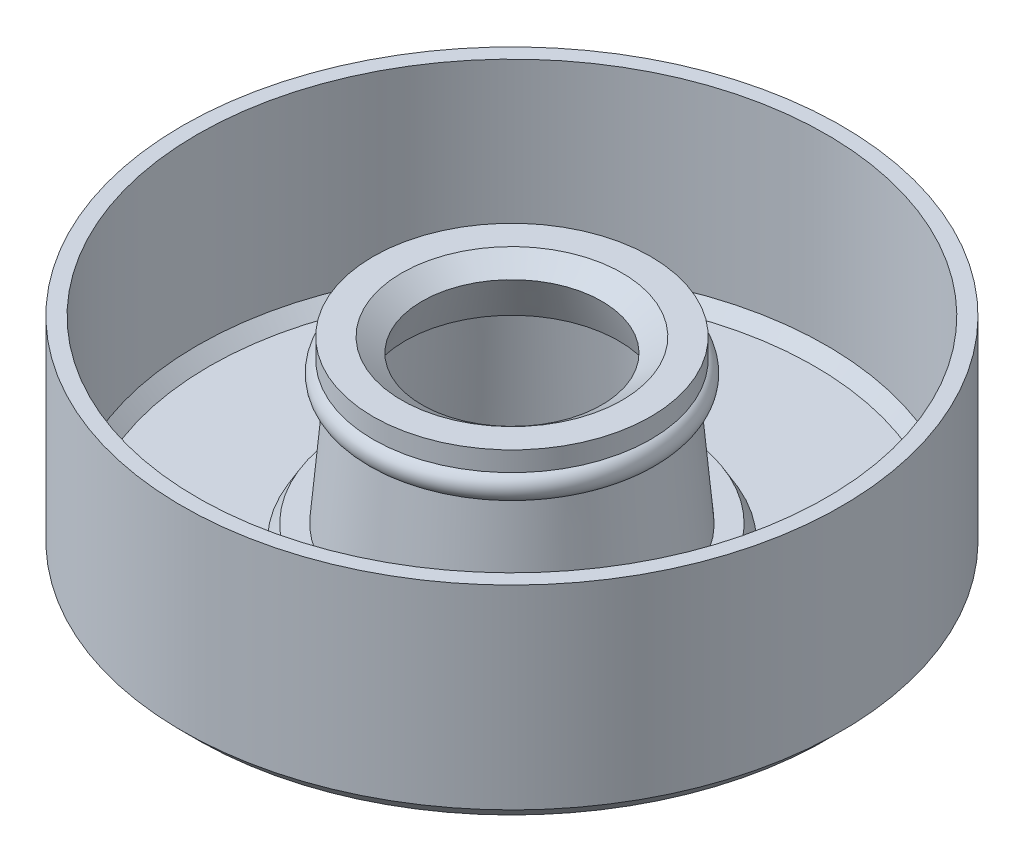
ISO-10303-21;
HEADER;
FILE_DESCRIPTION(('STEP AP214'),'2;1');
FILE_NAME('part.step','',(''),(''),'','','');
FILE_SCHEMA(('AUTOMOTIVE_DESIGN { 1 0 10303 214 1 1 1 1 }'));
ENDSEC;
DATA;
#1=APPLICATION_CONTEXT('core data for automotive mechanical design processes');
#2=APPLICATION_PROTOCOL_DEFINITION('international standard','automotive_design',2000,#1);
#3=PRODUCT_CONTEXT('',#1,'mechanical');
#4=PRODUCT('Part','Part','',(#3));
#5=PRODUCT_RELATED_PRODUCT_CATEGORY('part','',(#4));
#6=PRODUCT_DEFINITION_FORMATION('','',#4);
#7=PRODUCT_DEFINITION_CONTEXT('part definition',#1,'design');
#8=PRODUCT_DEFINITION('design','',#6,#7);
#9=PRODUCT_DEFINITION_SHAPE('','',#8);
#10=(LENGTH_UNIT() NAMED_UNIT(*) SI_UNIT(.MILLI.,.METRE.));
#11=(NAMED_UNIT(*) PLANE_ANGLE_UNIT() SI_UNIT($,.RADIAN.));
#12=(NAMED_UNIT(*) SI_UNIT($,.STERADIAN.) SOLID_ANGLE_UNIT());
#13=UNCERTAINTY_MEASURE_WITH_UNIT(LENGTH_MEASURE(1.E-05),#10,'distance_accuracy_value','');
#14=(GEOMETRIC_REPRESENTATION_CONTEXT(3) GLOBAL_UNCERTAINTY_ASSIGNED_CONTEXT((#13)) GLOBAL_UNIT_ASSIGNED_CONTEXT((#10,
#11,#12)) REPRESENTATION_CONTEXT('',''));
#15=CARTESIAN_POINT('',(0.,0.,0.));
#16=DIRECTION('',(0.,0.,1.));
#17=DIRECTION('',(1.,0.,0.));
#18=AXIS2_PLACEMENT_3D('',#15,#16,#17);
#19=CARTESIAN_POINT('',(0.,0.500000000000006,0.));
#20=DIRECTION('',(0.,1.,0.));
#21=DIRECTION('',(-1.,0.,0.));
#22=AXIS2_PLACEMENT_3D('',#19,#20,#21);
#23=CONICAL_SURFACE('',#22,11.0000000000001,0.785398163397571);
#24=CARTESIAN_POINT('',(0.,0.,0.));
#25=DIRECTION('',(0.,1.,0.));
#26=DIRECTION('',(-1.,0.,0.));
#27=AXIS2_PLACEMENT_3D('',#24,#25,#26);
#28=CIRCLE('',#27,10.4999999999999);
#29=CARTESIAN_POINT('',(-10.4999999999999,0.,0.));
#30=VERTEX_POINT('',#29);
#31=EDGE_CURVE('E10',#30,#30,#28,.T.);
#32=ORIENTED_EDGE('',*,*,#31,.T.);
#33=EDGE_LOOP('',(#32));
#34=FACE_BOUND('',#33,.T.);
#35=CARTESIAN_POINT('',(0.,0.500000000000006,0.));
#36=DIRECTION('',(0.,1.,0.));
#37=DIRECTION('',(-1.,0.,0.));
#38=AXIS2_PLACEMENT_3D('',#35,#36,#37);
#39=CIRCLE('',#38,11.0000000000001);
#40=CARTESIAN_POINT('',(-11.0000000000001,0.500000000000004,0.));
#41=VERTEX_POINT('',#40);
#42=EDGE_CURVE('E96',#41,#41,#39,.T.);
#43=ORIENTED_EDGE('',*,*,#42,.F.);
#44=EDGE_LOOP('',(#43));
#45=FACE_BOUND('',#44,.T.);
#46=ADVANCED_FACE('F29',(#34,#45),#23,.T.);
#47=CARTESIAN_POINT('',(-10.4999999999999,0.,0.));
#48=DIRECTION('',(0.,-1.,0.));
#49=DIRECTION('',(1.,0.,0.));
#50=AXIS2_PLACEMENT_3D('',#47,#48,#49);
#51=PLANE('',#50);
#52=CARTESIAN_POINT('',(0.,0.,0.));
#53=DIRECTION('',(0.,1.,0.));
#54=DIRECTION('',(-1.,0.,0.));
#55=AXIS2_PLACEMENT_3D('',#52,#53,#54);
#56=CIRCLE('',#55,5.76943913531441);
#57=CARTESIAN_POINT('',(-5.76943913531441,0.,0.));
#58=VERTEX_POINT('',#57);
#59=EDGE_CURVE('E35',#58,#58,#56,.T.);
#60=ORIENTED_EDGE('',*,*,#59,.T.);
#61=EDGE_LOOP('',(#60));
#62=FACE_BOUND('',#61,.T.);
#63=ORIENTED_EDGE('',*,*,#31,.F.);
#64=EDGE_LOOP('',(#63));
#65=FACE_BOUND('',#64,.T.);
#66=ADVANCED_FACE('F104',(#62,#65),#51,.T.);
#67=CARTESIAN_POINT('',(0.,1.04169796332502,0.));
#68=DIRECTION('',(0.,1.,0.));
#69=DIRECTION('',(-1.,0.,0.));
#70=AXIS2_PLACEMENT_3D('',#67,#68,#69);
#71=TOROIDAL_SURFACE('',#70,5.76943913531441,1.04169796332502);
#72=CARTESIAN_POINT('',(0.,0.500000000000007,0.));
#73=DIRECTION('',(0.,1.,0.));
#74=DIRECTION('',(-1.,0.,0.));
#75=AXIS2_PLACEMENT_3D('',#72,#73,#74);
#76=CIRCLE('',#75,4.87966502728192);
#77=CARTESIAN_POINT('',(-4.87966502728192,0.500000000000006,0.));
#78=VERTEX_POINT('',#77);
#79=EDGE_CURVE('E39',#78,#78,#76,.T.);
#80=ORIENTED_EDGE('',*,*,#79,.T.);
#81=EDGE_LOOP('',(#80));
#82=FACE_BOUND('',#81,.T.);
#83=ORIENTED_EDGE('',*,*,#59,.F.);
#84=EDGE_LOOP('',(#83));
#85=FACE_BOUND('',#84,.T.);
#86=ADVANCED_FACE('F108',(#82,#85),#71,.T.);
#87=CARTESIAN_POINT('',(0.,0.500000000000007,0.));
#88=DIRECTION('',(0.,1.,0.));
#89=DIRECTION('',(-1.,0.,0.));
#90=AXIS2_PLACEMENT_3D('',#87,#88,#89);
#91=CONICAL_SURFACE('',#90,4.87966502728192,0.845628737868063);
#92=CARTESIAN_POINT('',(0.,0.,0.));
#93=DIRECTION('',(0.,1.,0.));
#94=DIRECTION('',(-1.,0.,0.));
#95=AXIS2_PLACEMENT_3D('',#92,#93,#94);
#96=CIRCLE('',#95,4.31549163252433);
#97=CARTESIAN_POINT('',(-4.31549163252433,0.,0.));
#98=VERTEX_POINT('',#97);
#99=EDGE_CURVE('E43',#98,#98,#96,.T.);
#100=ORIENTED_EDGE('',*,*,#99,.T.);
#101=EDGE_LOOP('',(#100));
#102=FACE_BOUND('',#101,.T.);
#103=ORIENTED_EDGE('',*,*,#79,.F.);
#104=EDGE_LOOP('',(#103));
#105=FACE_BOUND('',#104,.T.);
#106=ADVANCED_FACE('F112',(#102,#105),#91,.T.);
#107=CARTESIAN_POINT('',(0.,0.,0.));
#108=DIRECTION('',(0.,-1.,0.));
#109=DIRECTION('',(1.,0.,0.));
#110=AXIS2_PLACEMENT_3D('',#107,#108,#109);
#111=CONICAL_SURFACE('',#110,4.31549163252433,1.48352986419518);
#112=CARTESIAN_POINT('',(0.,0.0656125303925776,0.));
#113=DIRECTION('',(0.,1.,0.));
#114=DIRECTION('',(-1.,0.,0.));
#115=AXIS2_PLACEMENT_3D('',#112,#113,#114);
#116=CIRCLE('',#115,3.56553697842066);
#117=CARTESIAN_POINT('',(-3.56553697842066,0.0656125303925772,0.));
#118=VERTEX_POINT('',#117);
#119=EDGE_CURVE('E48',#118,#118,#116,.T.);
#120=ORIENTED_EDGE('',*,*,#119,.T.);
#121=EDGE_LOOP('',(#120));
#122=FACE_BOUND('',#121,.T.);
#123=ORIENTED_EDGE('',*,*,#99,.F.);
#124=EDGE_LOOP('',(#123));
#125=FACE_BOUND('',#124,.T.);
#126=ADVANCED_FACE('F119',(#122,#125),#111,.F.);
#127=CARTESIAN_POINT('',(0.,0.0656125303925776,0.));
#128=DIRECTION('',(0.,1.,0.));
#129=DIRECTION('',(-1.,0.,0.));
#130=AXIS2_PLACEMENT_3D('',#127,#128,#129);
#131=CONICAL_SURFACE('',#130,3.56553697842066,1.04579765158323);
#132=CARTESIAN_POINT('',(0.,0.500000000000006,0.));
#133=DIRECTION('',(0.,1.,0.));
#134=DIRECTION('',(-1.,0.,0.));
#135=AXIS2_PLACEMENT_3D('',#132,#133,#134);
#136=CIRCLE('',#135,4.31549163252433);
#137=CARTESIAN_POINT('',(-4.31549163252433,0.500000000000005,0.));
#138=VERTEX_POINT('',#137);
#139=EDGE_CURVE('E51',#138,#138,#136,.T.);
#140=ORIENTED_EDGE('',*,*,#139,.T.);
#141=EDGE_LOOP('',(#140));
#142=FACE_BOUND('',#141,.T.);
#143=ORIENTED_EDGE('',*,*,#119,.F.);
#144=EDGE_LOOP('',(#143));
#145=FACE_BOUND('',#144,.T.);
#146=ADVANCED_FACE('F123',(#142,#145),#131,.F.);
#147=CARTESIAN_POINT('',(0.,0.500000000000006,0.));
#148=DIRECTION('',(0.,-1.,0.));
#149=DIRECTION('',(1.,0.,0.));
#150=AXIS2_PLACEMENT_3D('',#147,#148,#149);
#151=CONICAL_SURFACE('',#150,4.31549163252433,0.0872664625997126);
#152=CARTESIAN_POINT('',(0.,4.50000000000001,0.));
#153=DIRECTION('',(0.,1.,0.));
#154=DIRECTION('',(-1.,0.,0.));
#155=AXIS2_PLACEMENT_3D('',#152,#153,#154);
#156=CIRCLE('',#155,3.96553697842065);
#157=CARTESIAN_POINT('',(-3.96553697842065,4.50000000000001,0.));
#158=VERTEX_POINT('',#157);
#159=EDGE_CURVE('E54',#158,#158,#156,.T.);
#160=ORIENTED_EDGE('',*,*,#159,.T.);
#161=EDGE_LOOP('',(#160));
#162=FACE_BOUND('',#161,.T.);
#163=ORIENTED_EDGE('',*,*,#139,.F.);
#164=EDGE_LOOP('',(#163));
#165=FACE_BOUND('',#164,.T.);
#166=ADVANCED_FACE('F127',(#162,#165),#151,.F.);
#167=CARTESIAN_POINT('',(-3.56553697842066,4.50000000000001,0.));
#168=DIRECTION('',(0.,-1.,0.));
#169=DIRECTION('',(1.,0.,0.));
#170=AXIS2_PLACEMENT_3D('',#167,#168,#169);
#171=PLANE('',#170);
#172=CARTESIAN_POINT('',(0.,4.50000000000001,0.));
#173=DIRECTION('',(0.,1.,0.));
#174=DIRECTION('',(-1.,0.,0.));
#175=AXIS2_PLACEMENT_3D('',#172,#173,#174);
#176=CIRCLE('',#175,3.56553697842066);
#177=CARTESIAN_POINT('',(-3.56553697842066,4.50000000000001,0.));
#178=VERTEX_POINT('',#177);
#179=EDGE_CURVE('E57',#178,#178,#176,.T.);
#180=ORIENTED_EDGE('',*,*,#179,.T.);
#181=EDGE_LOOP('',(#180));
#182=FACE_BOUND('',#181,.T.);
#183=ORIENTED_EDGE('',*,*,#159,.F.);
#184=EDGE_LOOP('',(#183));
#185=FACE_BOUND('',#184,.T.);
#186=ADVANCED_FACE('F131',(#182,#185),#171,.T.);
#187=CARTESIAN_POINT('',(0.,4.50000000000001,0.));
#188=DIRECTION('',(0.,-1.,0.));
#189=DIRECTION('',(1.,0.,0.));
#190=AXIS2_PLACEMENT_3D('',#187,#188,#189);
#191=CONICAL_SURFACE('',#190,3.56553697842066,0.376946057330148);
#192=CARTESIAN_POINT('',(0.,5.92857142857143,0.));
#193=DIRECTION('',(0.,1.,0.));
#194=DIRECTION('',(-1.,0.,0.));
#195=AXIS2_PLACEMENT_3D('',#192,#193,#194);
#196=CIRCLE('',#195,3.);
#197=CARTESIAN_POINT('',(-3.,5.92857142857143,0.));
#198=VERTEX_POINT('',#197);
#199=EDGE_CURVE('E60',#198,#198,#196,.T.);
#200=ORIENTED_EDGE('',*,*,#199,.T.);
#201=EDGE_LOOP('',(#200));
#202=FACE_BOUND('',#201,.T.);
#203=ORIENTED_EDGE('',*,*,#179,.F.);
#204=EDGE_LOOP('',(#203));
#205=FACE_BOUND('',#204,.T.);
#206=ADVANCED_FACE('F135',(#202,#205),#191,.F.);
#207=CARTESIAN_POINT('',(0.,5.92857142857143,0.));
#208=DIRECTION('',(0.,1.,0.));
#209=DIRECTION('',(-1.,0.,0.));
#210=AXIS2_PLACEMENT_3D('',#207,#208,#209);
#211=CONICAL_SURFACE('',#210,3.,0.959931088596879);
#212=CARTESIAN_POINT('',(0.,6.40476190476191,0.));
#213=DIRECTION('',(0.,1.,0.));
#214=DIRECTION('',(-1.,0.,0.));
#215=AXIS2_PLACEMENT_3D('',#212,#213,#214);
#216=CIRCLE('',#215,3.68007047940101);
#217=CARTESIAN_POINT('',(-3.68007047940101,6.40476190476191,0.));
#218=VERTEX_POINT('',#217);
#219=EDGE_CURVE('E63',#218,#218,#216,.T.);
#220=ORIENTED_EDGE('',*,*,#219,.T.);
#221=EDGE_LOOP('',(#220));
#222=FACE_BOUND('',#221,.T.);
#223=ORIENTED_EDGE('',*,*,#199,.F.);
#224=EDGE_LOOP('',(#223));
#225=FACE_BOUND('',#224,.T.);
#226=ADVANCED_FACE('F139',(#222,#225),#211,.F.);
#227=CARTESIAN_POINT('',(-3.68007047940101,6.40476190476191,0.));
#228=DIRECTION('',(0.,1.,0.));
#229=DIRECTION('',(-1.,0.,0.));
#230=AXIS2_PLACEMENT_3D('',#227,#228,#229);
#231=PLANE('',#230);
#232=CARTESIAN_POINT('',(0.,6.40476190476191,0.));
#233=DIRECTION('',(0.,1.,0.));
#234=DIRECTION('',(-1.,0.,0.));
#235=AXIS2_PLACEMENT_3D('',#232,#233,#234);
#236=CIRCLE('',#235,4.63245143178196);
#237=CARTESIAN_POINT('',(-4.63245143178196,6.40476190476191,0.));
#238=VERTEX_POINT('',#237);
#239=EDGE_CURVE('E66',#238,#238,#236,.T.);
#240=ORIENTED_EDGE('',*,*,#239,.T.);
#241=EDGE_LOOP('',(#240));
#242=FACE_BOUND('',#241,.T.);
#243=ORIENTED_EDGE('',*,*,#219,.F.);
#244=EDGE_LOOP('',(#243));
#245=FACE_BOUND('',#244,.T.);
#246=ADVANCED_FACE('F143',(#242,#245),#231,.T.);
#247=CARTESIAN_POINT('',(0.,5.97733576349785,0.));
#248=DIRECTION('',(0.,1.,0.));
#249=DIRECTION('',(-1.,0.,0.));
#250=AXIS2_PLACEMENT_3D('',#247,#248,#249);
#251=CYLINDRICAL_SURFACE('',#250,4.63245143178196);
#252=CARTESIAN_POINT('',(0.,5.74721359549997,0.));
#253=DIRECTION('',(0.,1.,0.));
#254=DIRECTION('',(-1.,0.,0.));
#255=AXIS2_PLACEMENT_3D('',#252,#253,#254);
#256=CIRCLE('',#255,4.63245143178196);
#257=CARTESIAN_POINT('',(-4.63245143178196,5.74721359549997,0.));
#258=VERTEX_POINT('',#257);
#259=EDGE_CURVE('E69',#258,#258,#256,.T.);
#260=ORIENTED_EDGE('',*,*,#259,.T.);
#261=EDGE_LOOP('',(#260));
#262=FACE_BOUND('',#261,.T.);
#263=ORIENTED_EDGE('',*,*,#239,.F.);
#264=EDGE_LOOP('',(#263));
#265=FACE_BOUND('',#264,.T.);
#266=ADVANCED_FACE('F147',(#262,#265),#251,.T.);
#267=CARTESIAN_POINT('',(0.,5.34721359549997,0.));
#268=DIRECTION('',(0.,1.,0.));
#269=DIRECTION('',(-1.,0.,0.));
#270=AXIS2_PLACEMENT_3D('',#267,#268,#269);
#271=TOROIDAL_SURFACE('',#270,4.43245143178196,0.447213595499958);
#272=CARTESIAN_POINT('',(0.,4.90000000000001,0.));
#273=DIRECTION('',(0.,1.,0.));
#274=DIRECTION('',(-1.,0.,0.));
#275=AXIS2_PLACEMENT_3D('',#272,#273,#274);
#276=CIRCLE('',#275,4.43245143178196);
#277=CARTESIAN_POINT('',(-4.43245143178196,4.90000000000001,0.));
#278=VERTEX_POINT('',#277);
#279=EDGE_CURVE('E72',#278,#278,#276,.T.);
#280=ORIENTED_EDGE('',*,*,#279,.T.);
#281=EDGE_LOOP('',(#280));
#282=FACE_BOUND('',#281,.T.);
#283=ORIENTED_EDGE('',*,*,#259,.F.);
#284=EDGE_LOOP('',(#283));
#285=FACE_BOUND('',#284,.T.);
#286=ADVANCED_FACE('F151',(#282,#285),#271,.T.);
#287=CARTESIAN_POINT('',(0.,4.90000000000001,0.));
#288=DIRECTION('',(0.,-1.,0.));
#289=DIRECTION('',(1.,0.,0.));
#290=AXIS2_PLACEMENT_3D('',#287,#288,#289);
#291=CONICAL_SURFACE('',#290,4.43245143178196,0.0872664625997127);
#292=CARTESIAN_POINT('',(0.,1.00000000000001,0.));
#293=DIRECTION('',(0.,1.,0.));
#294=DIRECTION('',(-1.,0.,0.));
#295=AXIS2_PLACEMENT_3D('',#292,#293,#294);
#296=CIRCLE('',#295,4.77365721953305);
#297=CARTESIAN_POINT('',(-4.77365721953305,1.00000000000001,0.));
#298=VERTEX_POINT('',#297);
#299=EDGE_CURVE('E75',#298,#298,#296,.T.);
#300=ORIENTED_EDGE('',*,*,#299,.T.);
#301=EDGE_LOOP('',(#300));
#302=FACE_BOUND('',#301,.T.);
#303=ORIENTED_EDGE('',*,*,#279,.F.);
#304=EDGE_LOOP('',(#303));
#305=FACE_BOUND('',#304,.T.);
#306=ADVANCED_FACE('F155',(#302,#305),#291,.T.);
#307=CARTESIAN_POINT('',(-4.77365721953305,1.00000000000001,0.));
#308=DIRECTION('',(0.,1.,0.));
#309=DIRECTION('',(-1.,0.,0.));
#310=AXIS2_PLACEMENT_3D('',#307,#308,#309);
#311=PLANE('',#310);
#312=CARTESIAN_POINT('',(0.,1.00000000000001,0.));
#313=DIRECTION('',(0.,1.,0.));
#314=DIRECTION('',(-1.,0.,0.));
#315=AXIS2_PLACEMENT_3D('',#312,#313,#314);
#316=CIRCLE('',#315,5.48076400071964);
#317=CARTESIAN_POINT('',(-5.48076400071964,1.00000000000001,0.));
#318=VERTEX_POINT('',#317);
#319=EDGE_CURVE('E78',#318,#318,#316,.T.);
#320=ORIENTED_EDGE('',*,*,#319,.T.);
#321=EDGE_LOOP('',(#320));
#322=FACE_BOUND('',#321,.T.);
#323=ORIENTED_EDGE('',*,*,#299,.F.);
#324=EDGE_LOOP('',(#323));
#325=FACE_BOUND('',#324,.T.);
#326=ADVANCED_FACE('F159',(#322,#325),#311,.T.);
#327=CARTESIAN_POINT('',(0.,1.00000000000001,0.));
#328=DIRECTION('',(0.,-1.,0.));
#329=DIRECTION('',(1.,0.,0.));
#330=AXIS2_PLACEMENT_3D('',#327,#328,#329);
#331=CONICAL_SURFACE('',#330,5.48076400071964,0.523598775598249);
#332=CARTESIAN_POINT('',(0.,0.500000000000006,0.));
#333=DIRECTION('',(0.,1.,0.));
#334=DIRECTION('',(-1.,0.,0.));
#335=AXIS2_PLACEMENT_3D('',#332,#333,#334);
#336=CIRCLE('',#335,5.76943913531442);
#337=CARTESIAN_POINT('',(-5.76943913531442,0.500000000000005,0.));
#338=VERTEX_POINT('',#337);
#339=EDGE_CURVE('E81',#338,#338,#336,.T.);
#340=ORIENTED_EDGE('',*,*,#339,.T.);
#341=EDGE_LOOP('',(#340));
#342=FACE_BOUND('',#341,.T.);
#343=ORIENTED_EDGE('',*,*,#319,.F.);
#344=EDGE_LOOP('',(#343));
#345=FACE_BOUND('',#344,.T.);
#346=ADVANCED_FACE('F163',(#342,#345),#331,.T.);
#347=CARTESIAN_POINT('',(-10.1,0.500000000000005,0.));
#348=DIRECTION('',(0.,1.,0.));
#349=DIRECTION('',(-1.,0.,0.));
#350=AXIS2_PLACEMENT_3D('',#347,#348,#349);
#351=PLANE('',#350);
#352=CARTESIAN_POINT('',(0.,0.500000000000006,0.));
#353=DIRECTION('',(0.,1.,0.));
#354=DIRECTION('',(-1.,0.,0.));
#355=AXIS2_PLACEMENT_3D('',#352,#353,#354);
#356=CIRCLE('',#355,10.1);
#357=CARTESIAN_POINT('',(-10.1,0.500000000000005,0.));
#358=VERTEX_POINT('',#357);
#359=EDGE_CURVE('E84',#358,#358,#356,.T.);
#360=ORIENTED_EDGE('',*,*,#359,.T.);
#361=EDGE_LOOP('',(#360));
#362=FACE_BOUND('',#361,.T.);
#363=ORIENTED_EDGE('',*,*,#339,.F.);
#364=EDGE_LOOP('',(#363));
#365=FACE_BOUND('',#364,.T.);
#366=ADVANCED_FACE('F167',(#362,#365),#351,.T.);
#367=CARTESIAN_POINT('',(0.,0.500000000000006,0.));
#368=DIRECTION('',(0.,1.,0.));
#369=DIRECTION('',(-1.,0.,0.));
#370=AXIS2_PLACEMENT_3D('',#367,#368,#369);
#371=CONICAL_SURFACE('',#370,10.1,0.785398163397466);
#372=CARTESIAN_POINT('',(0.,0.899999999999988,0.));
#373=DIRECTION('',(0.,1.,0.));
#374=DIRECTION('',(-1.,0.,0.));
#375=AXIS2_PLACEMENT_3D('',#372,#373,#374);
#376=CIRCLE('',#375,10.5);
#377=CARTESIAN_POINT('',(-10.5,0.899999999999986,0.));
#378=VERTEX_POINT('',#377);
#379=EDGE_CURVE('E87',#378,#378,#376,.T.);
#380=ORIENTED_EDGE('',*,*,#379,.T.);
#381=EDGE_LOOP('',(#380));
#382=FACE_BOUND('',#381,.T.);
#383=ORIENTED_EDGE('',*,*,#359,.F.);
#384=EDGE_LOOP('',(#383));
#385=FACE_BOUND('',#384,.T.);
#386=ADVANCED_FACE('F171',(#382,#385),#371,.F.);
#387=CARTESIAN_POINT('',(0.,5.97733576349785,0.));
#388=DIRECTION('',(0.,1.,0.));
#389=DIRECTION('',(-1.,0.,0.));
#390=AXIS2_PLACEMENT_3D('',#387,#388,#389);
#391=CYLINDRICAL_SURFACE('',#390,10.5);
#392=CARTESIAN_POINT('',(0.,7.00000000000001,0.));
#393=DIRECTION('',(0.,1.,0.));
#394=DIRECTION('',(-1.,0.,0.));
#395=AXIS2_PLACEMENT_3D('',#392,#393,#394);
#396=CIRCLE('',#395,10.5);
#397=CARTESIAN_POINT('',(-10.5,7.00000000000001,0.));
#398=VERTEX_POINT('',#397);
#399=EDGE_CURVE('E90',#398,#398,#396,.T.);
#400=ORIENTED_EDGE('',*,*,#399,.T.);
#401=EDGE_LOOP('',(#400));
#402=FACE_BOUND('',#401,.T.);
#403=ORIENTED_EDGE('',*,*,#379,.F.);
#404=EDGE_LOOP('',(#403));
#405=FACE_BOUND('',#404,.T.);
#406=ADVANCED_FACE('F175',(#402,#405),#391,.F.);
#407=CARTESIAN_POINT('',(-10.5,7.00000000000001,0.));
#408=DIRECTION('',(0.,1.,0.));
#409=DIRECTION('',(-1.,0.,0.));
#410=AXIS2_PLACEMENT_3D('',#407,#408,#409);
#411=PLANE('',#410);
#412=CARTESIAN_POINT('',(0.,7.00000000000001,0.));
#413=DIRECTION('',(0.,1.,0.));
#414=DIRECTION('',(-1.,0.,0.));
#415=AXIS2_PLACEMENT_3D('',#412,#413,#414);
#416=CIRCLE('',#415,11.);
#417=CARTESIAN_POINT('',(-11.,7.00000000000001,0.));
#418=VERTEX_POINT('',#417);
#419=EDGE_CURVE('E93',#418,#418,#416,.T.);
#420=ORIENTED_EDGE('',*,*,#419,.T.);
#421=EDGE_LOOP('',(#420));
#422=FACE_BOUND('',#421,.T.);
#423=ORIENTED_EDGE('',*,*,#399,.F.);
#424=EDGE_LOOP('',(#423));
#425=FACE_BOUND('',#424,.T.);
#426=ADVANCED_FACE('F179',(#422,#425),#411,.T.);
#427=CARTESIAN_POINT('',(0.,5.97733576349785,0.));
#428=DIRECTION('',(0.,1.,0.));
#429=DIRECTION('',(-1.,0.,0.));
#430=AXIS2_PLACEMENT_3D('',#427,#428,#429);
#431=CYLINDRICAL_SURFACE('',#430,11.);
#432=ORIENTED_EDGE('',*,*,#42,.T.);
#433=EDGE_LOOP('',(#432));
#434=FACE_BOUND('',#433,.T.);
#435=ORIENTED_EDGE('',*,*,#419,.F.);
#436=EDGE_LOOP('',(#435));
#437=FACE_BOUND('',#436,.T.);
#438=ADVANCED_FACE('F100',(#434,#437),#431,.T.);
#439=CLOSED_SHELL('',(#46,#66,#86,#106,#126,#146,#166,#186,#206,#226,#246,#266,#286,#306,#326,
#346,#366,#386,#406,#426,#438));
#440=MANIFOLD_SOLID_BREP('B2',#439);
#441=ADVANCED_BREP_SHAPE_REPRESENTATION('',(#18,#440),#14);
#442=SHAPE_DEFINITION_REPRESENTATION(#9,#441);
ENDSEC;
END-ISO-10303-21;
